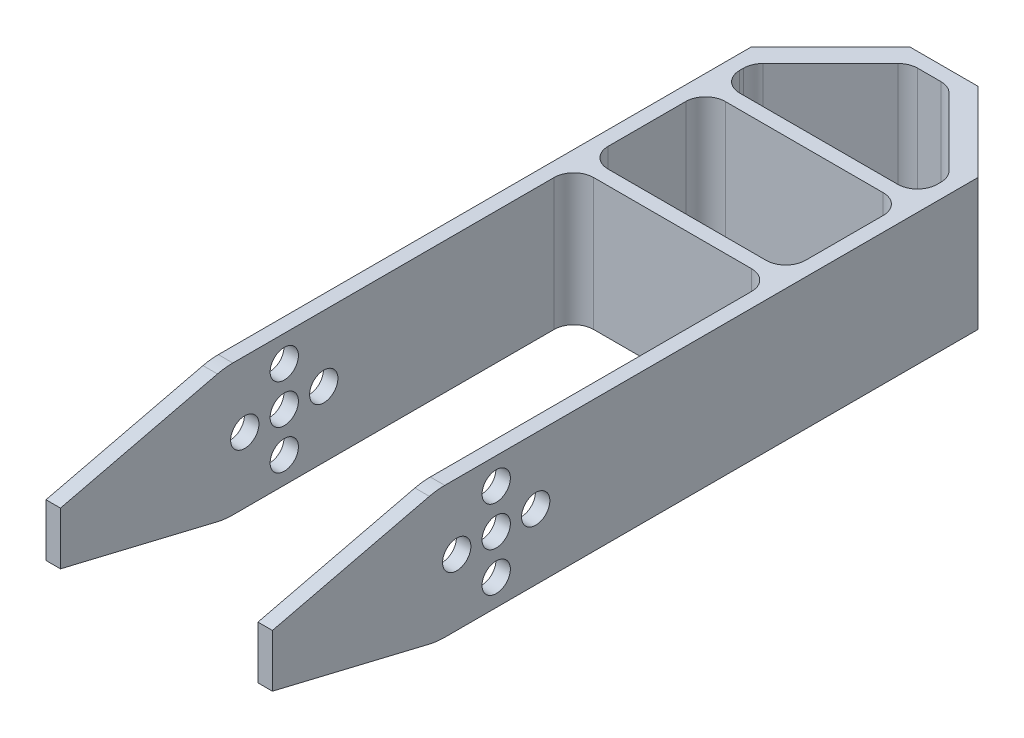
from build123d import *

# Parameters (mm, degrees)
BOSS_EXTRUDE1_DEPTH = 10
SKETCH2_R           = 2.15
CUT_EXTRUDE1_DEPTH  = 125.46686306


with BuildPart() as part:
    # Sketch1 → Boss-Extrude1 (new, symmetric)
    with BuildSketch(Plane(origin=(0, 0, 0), x_dir=(1, 0, 0), z_dir=(0, 1, 0))):
        with BuildLine():
            Line((5.2, 78), (29.2, 78))
            ThreePointArc((29.2, 78), (31.321320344, 77.121320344), (32.2, 75))
            Line((32.2, 75), (32.2, 0))
            Line((32.2, 0), (34.4, 0))
            Line((34.4, 0), (34.4, 107.2))
            Line((34.4, 107.2), (22.4, 119.2))
            Line((22.4, 119.2), (12, 119.2))
            Line((12, 119.2), (0, 107.2))
            Line((0, 107.2), (0, 0))
            Line((0, 0), (2.2, 0))
            Line((2.2, 0), (2.2, 75))
            ThreePointArc((2.2, 75), (3.078679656, 77.121320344), (5.2, 78))
        make_face()
        with BuildLine():
            ThreePointArc((21.079061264, 116.121320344), (20.105791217, 116.771638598), (18.95774092, 117))
            Line((18.95774092, 117), (15.44225908, 117))
            ThreePointArc((15.44225908, 117), (14.294208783, 116.771638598), (13.320938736, 116.121320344))
            Line((13.320938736, 116.121320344), (3.07853823, 105.878919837))
            ThreePointArc((3.07853823, 105.878919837), (2.428074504, 104.905298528), (2.19985867, 103.756839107))
            Line((2.19985867, 103.756839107), (2.2, 103.199239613))
            ThreePointArc((2.2, 103.199239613), (3.078948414, 101.078410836), (5.199999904, 100.2))
            Line((5.199999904, 100.2), (29.199999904, 100.2))
            ThreePointArc((29.199999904, 100.2), (31.321051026, 101.078410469), (32.199999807, 103.199238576))
            Line((32.199999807, 103.199238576), (32.20014133, 103.756838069))
            ThreePointArc((32.20014133, 103.756838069), (31.971925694, 104.905298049), (31.32146177, 105.878919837))
            Line((31.32146177, 105.878919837), (21.079061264, 116.121320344))
        make_face(mode=Mode.SUBTRACT)
        with BuildLine():
            Line((5.2, 98), (29.2, 98))
            ThreePointArc((29.2, 98), (31.321320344, 97.121320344), (32.2, 95))
            Line((32.2, 95), (32.2, 83.2))
            ThreePointArc((32.2, 83.2), (31.321320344, 81.078679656), (29.2, 80.2))
            Line((29.2, 80.2), (5.2, 80.2))
            ThreePointArc((5.2, 80.2), (3.078679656, 81.078679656), (2.2, 83.2))
            Line((2.2, 83.2), (2.2, 95))
            ThreePointArc((2.2, 95), (3.078679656, 97.121320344), (5.2, 98))
        make_face(mode=Mode.SUBTRACT)
    extrude(amount=BOSS_EXTRUDE1_DEPTH, both=True)

    # Sketch2 → Cut-Extrude1 (cut, through all)
    with BuildSketch(Plane(origin=(34.4, 0, 0), x_dir=(0, 0, -1), z_dir=(1, 0, 0))):
        with Locations((34, 0)):
            Circle(SKETCH2_R)
        with Locations((34, -6)):
            Circle(SKETCH2_R)
        with Locations((34, 6)):
            Circle(SKETCH2_R)
        with Locations((28, 0)):
            Circle(SKETCH2_R)
        with Locations((40, 0)):
            Circle(SKETCH2_R)
        with BuildLine():
            Line((0, 10), (0, 4))
            Line((0, 4), (23.849470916, 9.72387302))
            ThreePointArc((23.849470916, 9.72387302), (25.008196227, 9.930728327), (26.183200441, 10))
            Line((26.183200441, 10), (0, 10))
        make_face()
        with BuildLine():
            Line((0, -4), (23.849470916, -9.72387302))
            ThreePointArc((23.849470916, -9.72387302), (25.008196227, -9.930728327), (26.183200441, -10))
            Line((26.183200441, -10), (0, -10))
            Line((0, -10), (0, -4))
        make_face()
    extrude(amount=-CUT_EXTRUDE1_DEPTH, mode=Mode.SUBTRACT)


solid = part.part
